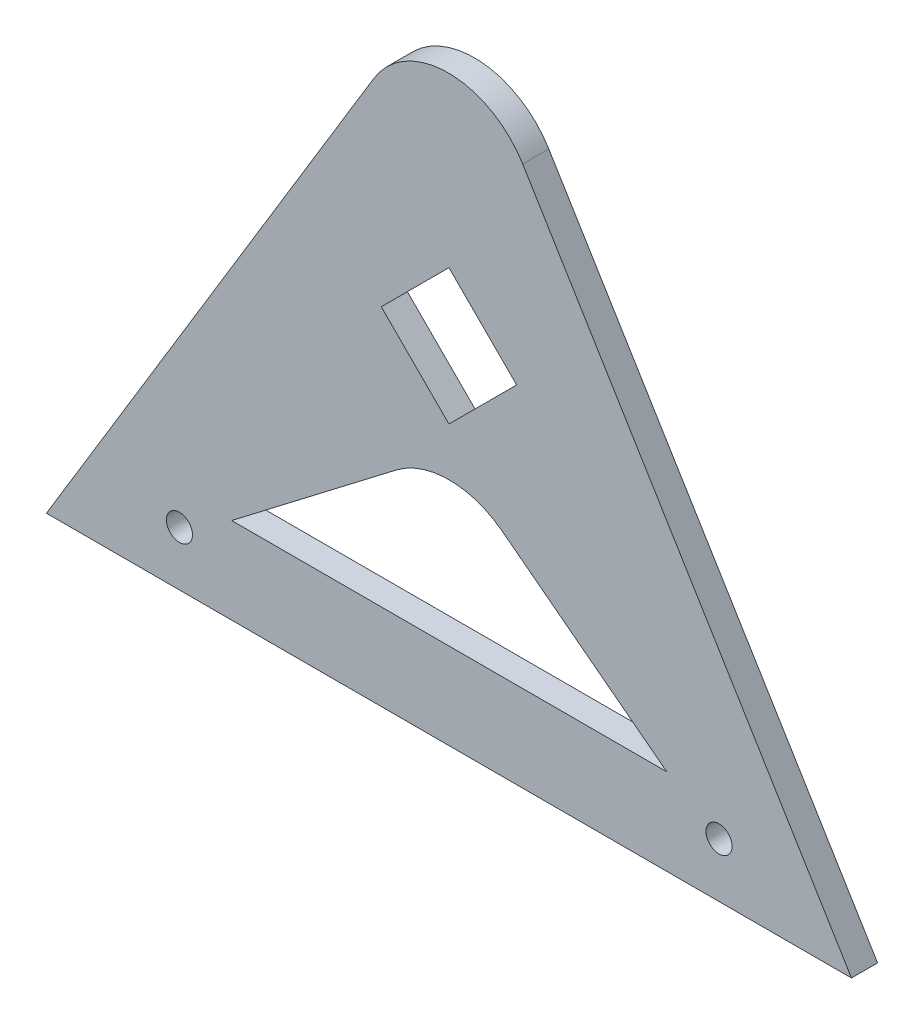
from build123d import *

# Parameters (mm, degrees)
ESQUISSE1_R      = 1.5
EXTRUSION1_DEPTH = 3


with BuildPart() as part:
    # Esquisse1 → Extrusion1 (new body)
    with BuildSketch(Plane.XY):
        with BuildLine():
            Line((46.115147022, 2.246247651), (8.339376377, 64.352924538))
            ThreePointArc((8.339376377, 64.352924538), (-0.212513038, 69.156291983), (-8.756536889, 64.338947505))
            Line((-8.756536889, 64.338947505), (-46.384852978, 2.246247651))
            Line((-46.384852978, 2.246247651), (46.115147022, 2.246247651))
        make_face()
        with Locations((-31.100798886, 8.481455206)):
            Circle(ESQUISSE1_R, mode=Mode.SUBTRACT)
        with Locations(Location((30.899201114, 8.481455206, 0), (0, 0, 180))):
            Circle(ESQUISSE1_R, mode=Mode.SUBTRACT)
        with BuildLine():
            Line((-6.180206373, 26.647609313), (-25.100798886, 12.160387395))
            Line((-25.100798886, 12.160387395), (24.899201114, 12.160387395))
            Line((24.899201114, 12.160387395), (5.978608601, 26.647609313))
            ThreePointArc((5.978608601, 26.647609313), (-0.100798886, 28.707785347), (-6.180206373, 26.647609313))
        make_face(mode=Mode.SUBTRACT)
        Polygon((-0.134852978, 49.802596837), (7.643321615, 42.024422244), (-0.134852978, 34.246247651), (-7.913027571, 42.024422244), align=None, mode=Mode.SUBTRACT)
    extrude(amount=EXTRUSION1_DEPTH)


solid = part.part
